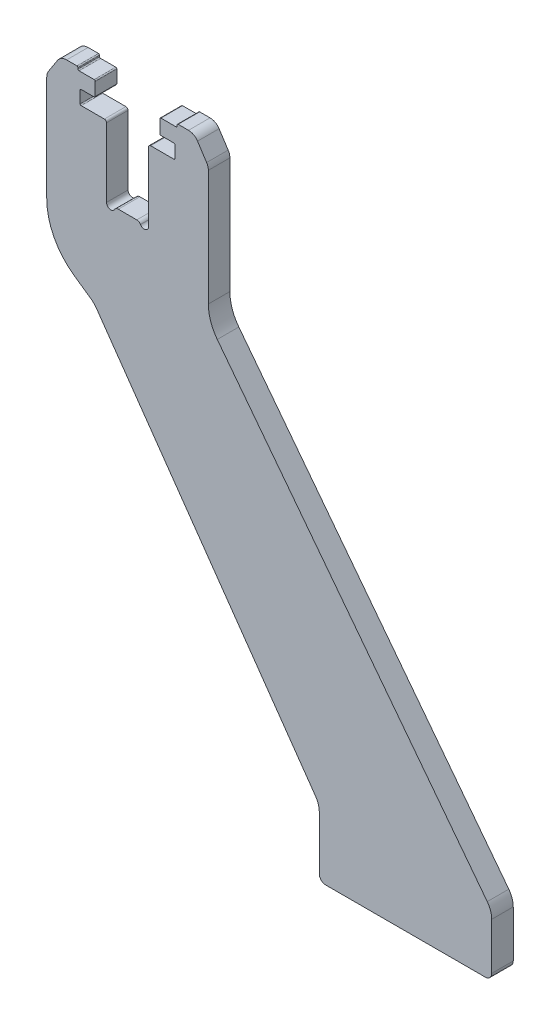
from build123d import *

# Parameters (mm, degrees)
EXTRUDE1_DEPTH = 10


with BuildPart() as part:
    # Sketch1 → Extrude1 (new body)
    with BuildSketch(Plane.XY):
        with BuildLine():
            Line((-4.285898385, 0), (4.285898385, 0))
            ThreePointArc((4.285898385, 0), (5.285898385, -0.267949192), (6.017949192, -1))
            ThreePointArc((6.017949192, -1), (8.26763809, -1.931851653), (9.75, 0))
            Line((9.75, 0), (9.75, 32))
            ThreePointArc((9.75, 32), (10.042893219, 32.707106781), (10.75, 33))
            Line((10.75, 33), (21.5, 33))
            ThreePointArc((21.5, 33), (21.853553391, 33.146446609), (22, 33.5))
            Line((22, 33.5), (22, 39))
            ThreePointArc((22, 39), (21.853553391, 39.353553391), (21.5, 39.5))
            Line((21.5, 39.5), (15.5, 39.5))
            ThreePointArc((15.5, 39.5), (15.146446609, 39.646446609), (15, 40))
            Line((15, 40), (15, 46))
            ThreePointArc((15, 46), (15.146446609, 46.353553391), (15.5, 46.5))
            Line((15.5, 46.5), (22.5, 46.5))
            ThreePointArc((22.5, 46.5), (22.853553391, 46.646446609), (23, 47))
            Line((23, 47), (23, 47.5))
            ThreePointArc((23, 47.5), (23.146446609, 47.853553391), (23.5, 48))
            Line((23.5, 48), (28.286569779, 48))
            ThreePointArc((28.286569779, 48), (30.671448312, 47.39458239), (32.478787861, 45.724941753))
            Line((32.478787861, 45.724941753), (36.692218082, 39.242741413))
            ThreePointArc((36.692218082, 39.242741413), (37.293802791, 37.938874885), (37.5, 36.51779966))
            Line((37.5, 36.51779966), (37.5, -17.210914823))
            ThreePointArc((37.5, -17.210914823), (38.56139741, -23.639704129), (41.632933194, -29.386143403))
            Line((41.632933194, -29.386143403), (166.933533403, -192.681064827))
            ThreePointArc((166.933533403, -192.681064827), (168.469301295, -195.554284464), (169, -198.768679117))
            Line((169, -198.768679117), (169, -220.5))
            ThreePointArc((169, -220.5), (168.121320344, -222.621320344), (166, -223.5))
            Line((166, -223.5), (92, -223.5))
            ThreePointArc((92, -223.5), (89.878679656, -222.621320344), (89, -220.5))
            Line((89, -220.5), (89, -195.799020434))
            ThreePointArc((89, -195.799020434), (88.537169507, -192.791962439), (87.191520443, -190.06325607))
            Line((87.191520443, -190.06325607), (-14.488629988, -44.848951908))
            ThreePointArc((-14.488629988, -44.848951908), (-15.609082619, -43.513648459), (-16.944386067, -42.393195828))
            Line((-16.944386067, -42.393195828), (-24.707293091, -36.957549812))
            ThreePointArc((-24.707293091, -36.957549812), (-34.110324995, -26.23544688), (-37.5, -12.382988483))
            Line((-37.5, -12.382988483), (-37.5, 36.51779966))
            ThreePointArc((-37.5, 36.51779966), (-37.293802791, 37.938874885), (-36.692218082, 39.242741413))
            Line((-36.692218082, 39.242741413), (-32.478787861, 45.724941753))
            ThreePointArc((-32.478787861, 45.724941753), (-30.671448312, 47.39458239), (-28.286569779, 48))
            Line((-28.286569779, 48), (-23.5, 48))
            ThreePointArc((-23.5, 48), (-23.146446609, 47.853553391), (-23, 47.5))
            Line((-23, 47.5), (-23, 47))
            ThreePointArc((-23, 47), (-22.853553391, 46.646446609), (-22.5, 46.5))
            Line((-22.5, 46.5), (-15.5, 46.5))
            ThreePointArc((-15.5, 46.5), (-15.146446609, 46.353553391), (-15, 46))
            Line((-15, 46), (-15, 40))
            ThreePointArc((-15, 40), (-15.146446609, 39.646446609), (-15.5, 39.5))
            Line((-15.5, 39.5), (-21.5, 39.5))
            ThreePointArc((-21.5, 39.5), (-21.853553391, 39.353553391), (-22, 39))
            Line((-22, 39), (-22, 33.5))
            ThreePointArc((-22, 33.5), (-21.853553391, 33.146446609), (-21.5, 33))
            Line((-21.5, 33), (-10.75, 33))
            ThreePointArc((-10.75, 33), (-10.042893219, 32.707106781), (-9.75, 32))
            Line((-9.75, 32), (-9.75, 0))
            ThreePointArc((-9.75, 0), (-8.26763809, -1.931851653), (-6.017949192, -1))
            ThreePointArc((-6.017949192, -1), (-5.285898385, -0.267949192), (-4.285898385, 0))
        make_face()
    extrude(amount=EXTRUDE1_DEPTH)


solid = part.part
